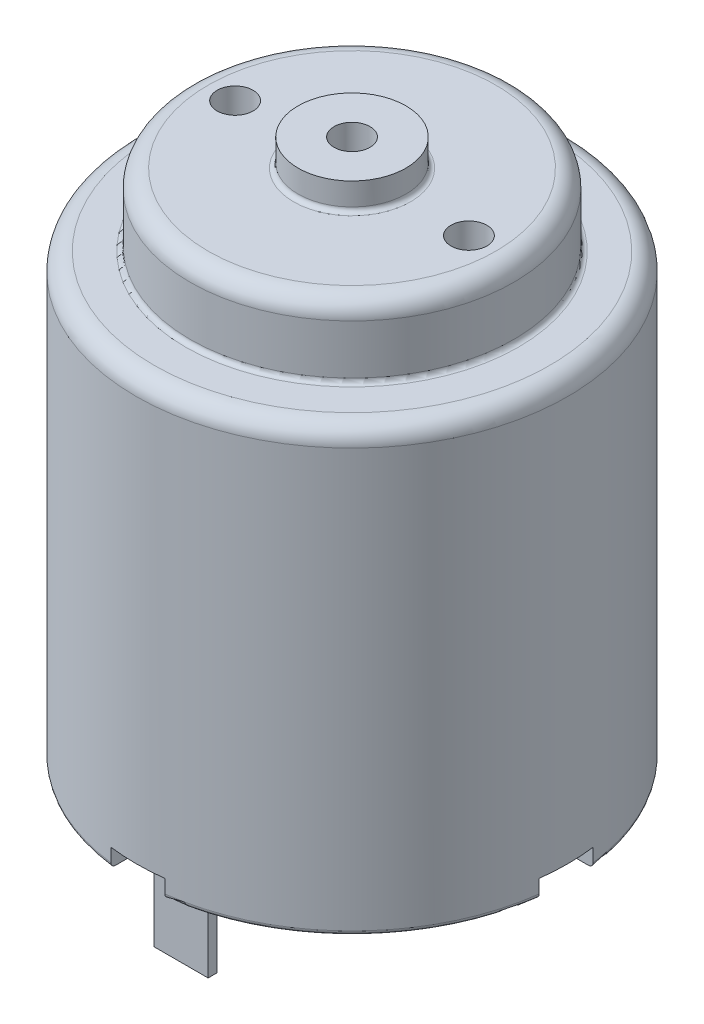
from build123d import *

# Parameters (mm, degrees)
SKETCH2_R           = 1
CUT_EXTRUDE1_DEPTH  = 32
FILLET1_R           = 1
FILLET3_R           = 0.25
CUT_EXTRUDE3_DEPTH  = 3
SKETCH4_R           = 1
CUT_EXTRUDE4_DEPTH  = 35.467375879
SKETCH5_W           = 3
SKETCH5_H           = 3
CUT_EXTRUDE8_DEPTH  = 1
SKETCH8_W           = 3
SKETCH8_H           = 4.82182538
CUT_EXTRUDE9_DEPTH  = 2
SKETCH10_R          = 1
CUT_EXTRUDE10_DEPTH = 1
SKETCH11_W          = 3
SKETCH11_H          = 0.5
EXTRUDE2_DEPTH      = 6


with BuildPart() as part:
    # Sketch1 → Revolve1 (revolve)
    with BuildSketch(Plane.XY, mode=Mode.PRIVATE) as revolve1_sk:
        Polygon((12, 2), (12, 26.5), (9, 26.5), (9, 30.5), (3, 30.5), (3, 32), (0, 32), (0, 0), (4, 0), (4, 2), align=None)
    revolve(revolve1_sk.sketch.rotate(Axis((0, -7.257702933, 0), (0, 1, 0)), 90), axis=Axis((0, -7.257702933, 0), (0, 1, 0)))

    # Sketch2 → Cut-Extrude1 (cut)
    with BuildSketch(Plane(origin=(0, 32, 0), x_dir=(-1, 0, 0), z_dir=(0, 1, 0))):
        with Locations(Location((0, 0, 0), (0, 0, 90))):
            Circle(SKETCH2_R)
    extrude(amount=-CUT_EXTRUDE1_DEPTH, mode=Mode.SUBTRACT)

    # Fillet1
    fillet1_edges = [part.edges().sort_by_distance(p)[0] for p in [
        (0, 30.5, 9),
        (0, 26.5, 12),
    ]]
    fillet(fillet1_edges, radius=FILLET1_R)

    # Fillet3
    fillet3_edges = [part.edges().sort_by_distance(p)[0] for p in [
        (0, 0, 4),
        (0, 30.5, 3),
        (0, 26.5, 9),
        (0, 2, 12),
        (0, 2, 4),
    ]]
    fillet(fillet3_edges, radius=FILLET3_R)

    # Sketch3 → Cut-Extrude3 (cut)
    with BuildSketch(Plane.XZ):
        with BuildLine():
            ThreePointArc((-6.495190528, -3.75), (0, -7.5), (6.495190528, -3.75))
            ThreePointArc((6.495190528, -3.75), (6.037658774, -2.042468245), (4.330127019, -2.5))
            ThreePointArc((4.330127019, -2.5), (0, -5), (-4.330127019, -2.5))
            ThreePointArc((-4.330127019, -2.5), (-6.037658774, -2.042468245), (-6.495190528, -3.75))
        make_face()
        with BuildLine():
            ThreePointArc((4.330127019, 2.5), (6.037658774, 2.042468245), (6.495190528, 3.75))
            ThreePointArc((6.495190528, 3.75), (0, 7.5), (-6.495190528, 3.75))
            ThreePointArc((-6.495190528, 3.75), (-6.037658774, 2.042468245), (-4.330127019, 2.5))
            ThreePointArc((-4.330127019, 2.5), (0, 5), (4.330127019, 2.5))
        make_face()
    extrude(amount=-CUT_EXTRUDE3_DEPTH, mode=Mode.SUBTRACT)

    # Sketch4 → Cut-Extrude4 (cut, through all)
    with BuildSketch(Plane.XZ.offset(-2)):
        with Locations(Location((6.5, 0, 0), (0, 0, 270))):
            Circle(SKETCH4_R)
        with Locations(Location((-6.5, 0, 0), (0, 0, 270))):
            Circle(SKETCH4_R)
    extrude(amount=-CUT_EXTRUDE4_DEPTH, mode=Mode.SUBTRACT)

    # Sketch5 → Cut-Extrude8 (cut)
    with BuildSketch(Plane.XZ.offset(-2)):
        with BuildLine():
            Line((-10.5, 1.5), (-12, 1.5))
            Line((-12, 1.5), (-12, -1.498))
            Line((-12, -1.498), (-10.422566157, -1.498))
            ThreePointArc((-10.422566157, -1.498), (-9.000500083, 0.038729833), (-10.5, 1.5))
        make_face()
        with BuildLine():
            ThreePointArc((10.5, 1.5), (9.000500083, 0.038729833), (10.422566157, -1.498))
            Line((10.422566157, -1.498), (12, -1.498))
            Line((12, -1.498), (12, 1.5))
            Line((12, 1.5), (10.5, 1.5))
        make_face()
        with Locations((-0.001, 10.501)):
            Rectangle(SKETCH5_W, SKETCH5_H)
        with Locations((-0.001, -10.499)):
            Rectangle(SKETCH5_W, SKETCH5_H)
    extrude(amount=-CUT_EXTRUDE8_DEPTH, mode=Mode.SUBTRACT)

    # Sketch8 → Cut-Extrude9 (cut)
    with BuildSketch(Plane.XZ):
        with Locations((5, 0)):
            Rectangle(SKETCH8_W, SKETCH8_H)
    extrude(amount=-CUT_EXTRUDE9_DEPTH, mode=Mode.SUBTRACT)

    # Sketch10 → Cut-Extrude10 (cut)
    with BuildSketch(Plane.XZ.offset(-2)):
        with Locations(Location((3.5, 9.001, 0), (0, 0, 270))):
            Circle(SKETCH10_R)
    extrude(amount=-CUT_EXTRUDE10_DEPTH, mode=Mode.SUBTRACT)

    # Sketch11 → Extrude2 (add)
    with BuildSketch(Plane.XZ.offset(-3)):
        with Locations((-0.001, 9.251)):
            Rectangle(SKETCH11_W, SKETCH11_H)
        with Locations((-0.001, -9.249)):
            Rectangle(SKETCH11_W, SKETCH11_H)
    extrude(amount=EXTRUDE2_DEPTH)


solid = part.part
